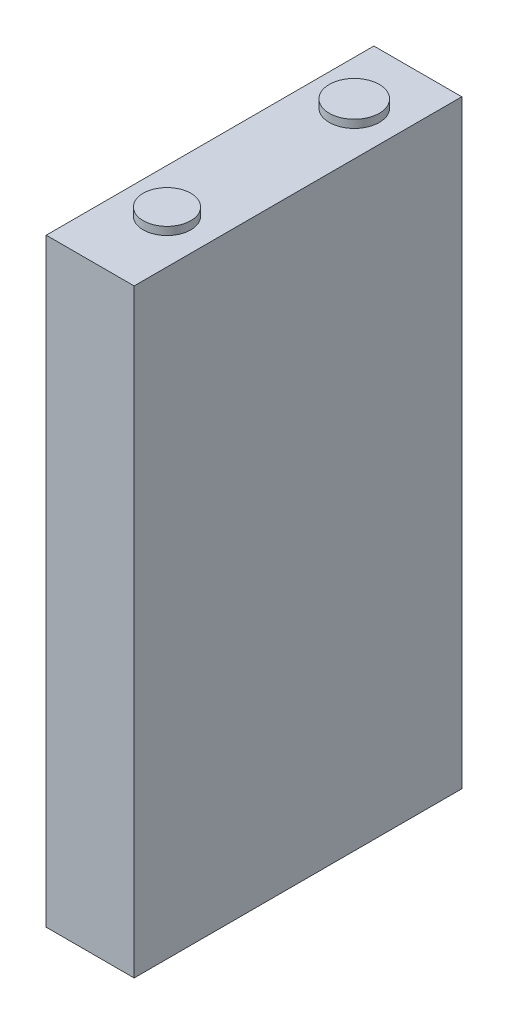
ISO-10303-21;
HEADER;
FILE_DESCRIPTION(('STEP AP214'),'2;1');
FILE_NAME('part.step','',(''),(''),'','','');
FILE_SCHEMA(('AUTOMOTIVE_DESIGN { 1 0 10303 214 1 1 1 1 }'));
ENDSEC;
DATA;
#1=APPLICATION_CONTEXT('core data for automotive mechanical design processes');
#2=APPLICATION_PROTOCOL_DEFINITION('international standard','automotive_design',2000,#1);
#3=PRODUCT_CONTEXT('',#1,'mechanical');
#4=PRODUCT('Part','Part','',(#3));
#5=PRODUCT_RELATED_PRODUCT_CATEGORY('part','',(#4));
#6=PRODUCT_DEFINITION_FORMATION('','',#4);
#7=PRODUCT_DEFINITION_CONTEXT('part definition',#1,'design');
#8=PRODUCT_DEFINITION('design','',#6,#7);
#9=PRODUCT_DEFINITION_SHAPE('','',#8);
#10=(LENGTH_UNIT() NAMED_UNIT(*) SI_UNIT(.MILLI.,.METRE.));
#11=(NAMED_UNIT(*) PLANE_ANGLE_UNIT() SI_UNIT($,.RADIAN.));
#12=(NAMED_UNIT(*) SI_UNIT($,.STERADIAN.) SOLID_ANGLE_UNIT());
#13=UNCERTAINTY_MEASURE_WITH_UNIT(LENGTH_MEASURE(1.E-05),#10,'distance_accuracy_value','');
#14=(GEOMETRIC_REPRESENTATION_CONTEXT(3) GLOBAL_UNCERTAINTY_ASSIGNED_CONTEXT((#13)) GLOBAL_UNIT_ASSIGNED_CONTEXT((#10,
#11,#12)) REPRESENTATION_CONTEXT('',''));
#15=CARTESIAN_POINT('',(0.,0.,0.));
#16=DIRECTION('',(0.,0.,1.));
#17=DIRECTION('',(1.,0.,0.));
#18=AXIS2_PLACEMENT_3D('',#15,#16,#17);
#19=CARTESIAN_POINT('',(17.4625,-119.0625,-65.0875));
#20=DIRECTION('',(0.,0.,1.));
#21=DIRECTION('',(1.,0.,0.));
#22=AXIS2_PLACEMENT_3D('',#19,#20,#21);
#23=PLANE('',#22);
#24=DIRECTION('',(0.,1.,0.));
#25=VECTOR('',#24,1.);
#26=CARTESIAN_POINT('',(-17.4625,-119.0625,-65.0875));
#27=LINE('',#26,#25);
#28=CARTESIAN_POINT('',(-17.4625,-119.0625,-65.0875));
#29=VERTEX_POINT('',#28);
#30=CARTESIAN_POINT('',(-17.4625,119.0625,-65.0875));
#31=VERTEX_POINT('',#30);
#32=EDGE_CURVE('E108',#29,#31,#27,.T.);
#33=ORIENTED_EDGE('',*,*,#32,.T.);
#34=DIRECTION('',(-1.,0.,0.));
#35=VECTOR('',#34,1.);
#36=CARTESIAN_POINT('',(17.4625,119.0625,-65.0875));
#37=LINE('',#36,#35);
#38=CARTESIAN_POINT('',(17.4625,119.0625,-65.0875));
#39=VERTEX_POINT('',#38);
#40=EDGE_CURVE('E99',#39,#31,#37,.T.);
#41=ORIENTED_EDGE('',*,*,#40,.F.);
#42=DIRECTION('',(0.,1.,0.));
#43=VECTOR('',#42,1.);
#44=CARTESIAN_POINT('',(17.4625,-119.0625,-65.0875));
#45=LINE('',#44,#43);
#46=CARTESIAN_POINT('',(17.4625,-119.0625,-65.0875));
#47=VERTEX_POINT('',#46);
#48=EDGE_CURVE('E93',#47,#39,#45,.T.);
#49=ORIENTED_EDGE('',*,*,#48,.F.);
#50=DIRECTION('',(-1.,0.,0.));
#51=VECTOR('',#50,1.);
#52=CARTESIAN_POINT('',(17.4625,-119.0625,-65.0875));
#53=LINE('',#52,#51);
#54=EDGE_CURVE('E104',#47,#29,#53,.T.);
#55=ORIENTED_EDGE('',*,*,#54,.T.);
#56=EDGE_LOOP('',(#33,#41,#49,#55));
#57=FACE_BOUND('',#56,.T.);
#58=ADVANCED_FACE('F41',(#57),#23,.F.);
#59=CARTESIAN_POINT('',(17.4625,119.0625,65.0875));
#60=DIRECTION('',(0.,-1.,0.));
#61=DIRECTION('',(0.,0.,-1.));
#62=AXIS2_PLACEMENT_3D('',#59,#60,#61);
#63=PLANE('',#62);
#64=CARTESIAN_POINT('',(0.,119.0625,34.5652667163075));
#65=DIRECTION('',(0.,-1.,0.));
#66=DIRECTION('',(0.,0.,-1.));
#67=AXIS2_PLACEMENT_3D('',#64,#65,#66);
#68=CIRCLE('',#67,9.44596333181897);
#69=CARTESIAN_POINT('',(0.,119.0625,25.1193033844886));
#70=VERTEX_POINT('',#69);
#71=EDGE_CURVE('E11',#70,#70,#68,.F.);
#72=ORIENTED_EDGE('',*,*,#71,.F.);
#73=EDGE_LOOP('',(#72));
#74=FACE_BOUND('',#73,.T.);
#75=CARTESIAN_POINT('',(0.,119.0625,-39.8410179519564));
#76=DIRECTION('',(0.,-1.,0.));
#77=DIRECTION('',(0.,0.,-1.));
#78=AXIS2_PLACEMENT_3D('',#75,#76,#77);
#79=CIRCLE('',#78,9.93103342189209);
#80=CARTESIAN_POINT('',(0.,119.0625,-49.7720513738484));
#81=VERTEX_POINT('',#80);
#82=EDGE_CURVE('E49',#81,#81,#79,.F.);
#83=ORIENTED_EDGE('',*,*,#82,.F.);
#84=EDGE_LOOP('',(#83));
#85=FACE_BOUND('',#84,.T.);
#86=DIRECTION('',(0.,0.,1.));
#87=VECTOR('',#86,1.);
#88=CARTESIAN_POINT('',(-17.4625,119.0625,65.0875));
#89=LINE('',#88,#87);
#90=CARTESIAN_POINT('',(-17.4625,119.0625,65.0875));
#91=VERTEX_POINT('',#90);
#92=EDGE_CURVE('E98',#31,#91,#89,.T.);
#93=ORIENTED_EDGE('',*,*,#92,.T.);
#94=DIRECTION('',(-1.,0.,0.));
#95=VECTOR('',#94,1.);
#96=CARTESIAN_POINT('',(17.4625,119.0625,65.0875));
#97=LINE('',#96,#95);
#98=CARTESIAN_POINT('',(17.4625,119.0625,65.0875));
#99=VERTEX_POINT('',#98);
#100=EDGE_CURVE('E96',#99,#91,#97,.T.);
#101=ORIENTED_EDGE('',*,*,#100,.F.);
#102=DIRECTION('',(0.,0.,1.));
#103=VECTOR('',#102,1.);
#104=CARTESIAN_POINT('',(17.4625,119.0625,65.0875));
#105=LINE('',#104,#103);
#106=EDGE_CURVE('E88',#39,#99,#105,.T.);
#107=ORIENTED_EDGE('',*,*,#106,.F.);
#108=ORIENTED_EDGE('',*,*,#40,.T.);
#109=EDGE_LOOP('',(#93,#101,#107,#108));
#110=FACE_BOUND('',#109,.T.);
#111=ADVANCED_FACE('F97',(#74,#85,#110),#63,.F.);
#112=CARTESIAN_POINT('',(17.4625,-119.0625,65.0875));
#113=DIRECTION('',(0.,0.,-1.));
#114=DIRECTION('',(-1.,0.,0.));
#115=AXIS2_PLACEMENT_3D('',#112,#113,#114);
#116=PLANE('',#115);
#117=DIRECTION('',(0.,-1.,0.));
#118=VECTOR('',#117,1.);
#119=CARTESIAN_POINT('',(-17.4625,-119.0625,65.0875));
#120=LINE('',#119,#118);
#121=CARTESIAN_POINT('',(-17.4625,-119.0625,65.0875));
#122=VERTEX_POINT('',#121);
#123=EDGE_CURVE('E74',#91,#122,#120,.T.);
#124=ORIENTED_EDGE('',*,*,#123,.T.);
#125=DIRECTION('',(-1.,0.,0.));
#126=VECTOR('',#125,1.);
#127=CARTESIAN_POINT('',(17.4625,-119.0625,65.0875));
#128=LINE('',#127,#126);
#129=CARTESIAN_POINT('',(17.4625,-119.0625,65.0875));
#130=VERTEX_POINT('',#129);
#131=EDGE_CURVE('E100',#130,#122,#128,.T.);
#132=ORIENTED_EDGE('',*,*,#131,.F.);
#133=DIRECTION('',(0.,-1.,0.));
#134=VECTOR('',#133,1.);
#135=CARTESIAN_POINT('',(17.4625,-119.0625,65.0875));
#136=LINE('',#135,#134);
#137=EDGE_CURVE('E91',#99,#130,#136,.T.);
#138=ORIENTED_EDGE('',*,*,#137,.F.);
#139=ORIENTED_EDGE('',*,*,#100,.T.);
#140=EDGE_LOOP('',(#124,#132,#138,#139));
#141=FACE_BOUND('',#140,.T.);
#142=ADVANCED_FACE('F102',(#141),#116,.F.);
#143=CARTESIAN_POINT('',(17.4625,-119.0625,65.0875));
#144=DIRECTION('',(0.,1.,0.));
#145=DIRECTION('',(0.,0.,1.));
#146=AXIS2_PLACEMENT_3D('',#143,#144,#145);
#147=PLANE('',#146);
#148=DIRECTION('',(0.,0.,-1.));
#149=VECTOR('',#148,1.);
#150=CARTESIAN_POINT('',(-17.4625,-119.0625,65.0875));
#151=LINE('',#150,#149);
#152=EDGE_CURVE('E80',#122,#29,#151,.T.);
#153=ORIENTED_EDGE('',*,*,#152,.T.);
#154=ORIENTED_EDGE('',*,*,#54,.F.);
#155=DIRECTION('',(0.,0.,-1.));
#156=VECTOR('',#155,1.);
#157=CARTESIAN_POINT('',(17.4625,-119.0625,65.0875));
#158=LINE('',#157,#156);
#159=EDGE_CURVE('E57',#130,#47,#158,.T.);
#160=ORIENTED_EDGE('',*,*,#159,.F.);
#161=ORIENTED_EDGE('',*,*,#131,.T.);
#162=EDGE_LOOP('',(#153,#154,#160,#161));
#163=FACE_BOUND('',#162,.T.);
#164=ADVANCED_FACE('F128',(#163),#147,.F.);
#165=CARTESIAN_POINT('',(17.4625,0.,0.));
#166=DIRECTION('',(-1.,0.,0.));
#167=DIRECTION('',(0.,0.,1.));
#168=AXIS2_PLACEMENT_3D('',#165,#166,#167);
#169=PLANE('',#168);
#170=ORIENTED_EDGE('',*,*,#48,.T.);
#171=ORIENTED_EDGE('',*,*,#106,.T.);
#172=ORIENTED_EDGE('',*,*,#137,.T.);
#173=ORIENTED_EDGE('',*,*,#159,.T.);
#174=EDGE_LOOP('',(#170,#171,#172,#173));
#175=FACE_BOUND('',#174,.T.);
#176=ADVANCED_FACE('F89',(#175),#169,.F.);
#177=CARTESIAN_POINT('',(-17.4625,0.,0.));
#178=DIRECTION('',(-1.,0.,0.));
#179=DIRECTION('',(0.,0.,1.));
#180=AXIS2_PLACEMENT_3D('',#177,#178,#179);
#181=PLANE('',#180);
#182=ORIENTED_EDGE('',*,*,#32,.F.);
#183=ORIENTED_EDGE('',*,*,#152,.F.);
#184=ORIENTED_EDGE('',*,*,#123,.F.);
#185=ORIENTED_EDGE('',*,*,#92,.F.);
#186=EDGE_LOOP('',(#182,#183,#184,#185));
#187=FACE_BOUND('',#186,.T.);
#188=ADVANCED_FACE('F135',(#187),#181,.T.);
#189=CARTESIAN_POINT('',(0.,122.2375,-39.8410179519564));
#190=DIRECTION('',(0.,-1.,0.));
#191=DIRECTION('',(0.,0.,-1.));
#192=AXIS2_PLACEMENT_3D('',#189,#190,#191);
#193=CYLINDRICAL_SURFACE('',#192,9.93103342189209);
#194=CARTESIAN_POINT('',(0.,122.2375,-39.8410179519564));
#195=DIRECTION('',(0.,1.,0.));
#196=DIRECTION('',(0.,0.,1.));
#197=AXIS2_PLACEMENT_3D('',#194,#195,#196);
#198=CIRCLE('',#197,9.93103342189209);
#199=CARTESIAN_POINT('',(0.,122.2375,-29.9099845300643));
#200=VERTEX_POINT('',#199);
#201=EDGE_CURVE('E111',#200,#200,#198,.T.);
#202=ORIENTED_EDGE('',*,*,#201,.F.);
#203=EDGE_LOOP('',(#202));
#204=FACE_BOUND('',#203,.T.);
#205=ORIENTED_EDGE('',*,*,#82,.T.);
#206=EDGE_LOOP('',(#205));
#207=FACE_BOUND('',#206,.T.);
#208=ADVANCED_FACE('F120',(#204,#207),#193,.T.);
#209=CARTESIAN_POINT('',(0.,122.2375,-39.8410179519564));
#210=DIRECTION('',(0.,1.,0.));
#211=DIRECTION('',(0.,0.,1.));
#212=AXIS2_PLACEMENT_3D('',#209,#210,#211);
#213=PLANE('',#212);
#214=ORIENTED_EDGE('',*,*,#201,.T.);
#215=EDGE_LOOP('',(#214));
#216=FACE_BOUND('',#215,.T.);
#217=ADVANCED_FACE('F143',(#216),#213,.T.);
#218=CARTESIAN_POINT('',(0.,122.2375,34.5652667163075));
#219=DIRECTION('',(0.,-1.,0.));
#220=DIRECTION('',(0.,0.,-1.));
#221=AXIS2_PLACEMENT_3D('',#218,#219,#220);
#222=CYLINDRICAL_SURFACE('',#221,9.44596333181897);
#223=CARTESIAN_POINT('',(0.,122.2375,34.5652667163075));
#224=DIRECTION('',(0.,1.,0.));
#225=DIRECTION('',(0.,0.,1.));
#226=AXIS2_PLACEMENT_3D('',#223,#224,#225);
#227=CIRCLE('',#226,9.44596333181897);
#228=CARTESIAN_POINT('',(0.,122.2375,44.0112300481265));
#229=VERTEX_POINT('',#228);
#230=EDGE_CURVE('E160',#229,#229,#227,.T.);
#231=ORIENTED_EDGE('',*,*,#230,.F.);
#232=EDGE_LOOP('',(#231));
#233=FACE_BOUND('',#232,.T.);
#234=ORIENTED_EDGE('',*,*,#71,.T.);
#235=EDGE_LOOP('',(#234));
#236=FACE_BOUND('',#235,.T.);
#237=ADVANCED_FACE('F147',(#233,#236),#222,.T.);
#238=CARTESIAN_POINT('',(0.,122.2375,34.5652667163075));
#239=DIRECTION('',(0.,1.,0.));
#240=DIRECTION('',(0.,0.,1.));
#241=AXIS2_PLACEMENT_3D('',#238,#239,#240);
#242=PLANE('',#241);
#243=ORIENTED_EDGE('',*,*,#230,.T.);
#244=EDGE_LOOP('',(#243));
#245=FACE_BOUND('',#244,.T.);
#246=ADVANCED_FACE('F149',(#245),#242,.T.);
#247=CLOSED_SHELL('',(#58,#111,#142,#164,#176,#188,#208,#217,#237,#246));
#248=MANIFOLD_SOLID_BREP('B2',#247);
#249=ADVANCED_BREP_SHAPE_REPRESENTATION('',(#18,#248),#14);
#250=SHAPE_DEFINITION_REPRESENTATION(#9,#249);
ENDSEC;
END-ISO-10303-21;
